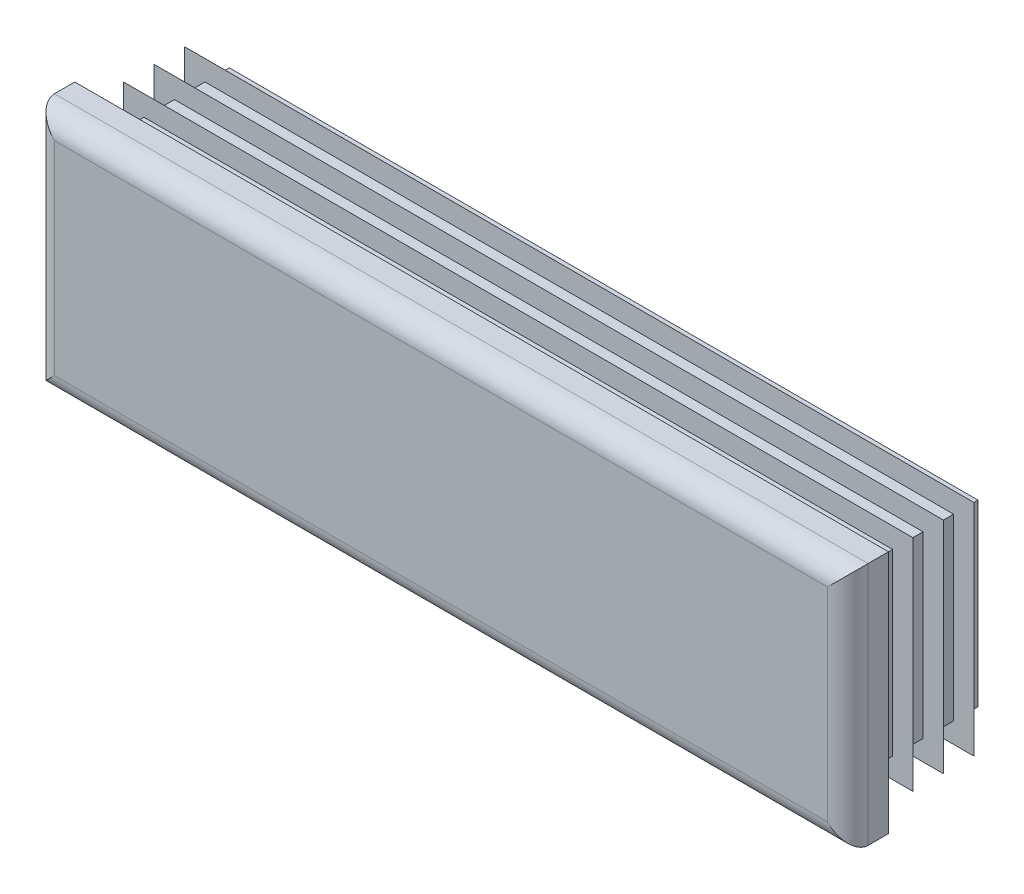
ISO-10303-21;
HEADER;
FILE_DESCRIPTION(('STEP AP214'),'2;1');
FILE_NAME('part.step','',(''),(''),'','','');
FILE_SCHEMA(('AUTOMOTIVE_DESIGN { 1 0 10303 214 1 1 1 1 }'));
ENDSEC;
DATA;
#1=APPLICATION_CONTEXT('core data for automotive mechanical design processes');
#2=APPLICATION_PROTOCOL_DEFINITION('international standard','automotive_design',2000,#1);
#3=PRODUCT_CONTEXT('',#1,'mechanical');
#4=PRODUCT('Part','Part','',(#3));
#5=PRODUCT_RELATED_PRODUCT_CATEGORY('part','',(#4));
#6=PRODUCT_DEFINITION_FORMATION('','',#4);
#7=PRODUCT_DEFINITION_CONTEXT('part definition',#1,'design');
#8=PRODUCT_DEFINITION('design','',#6,#7);
#9=PRODUCT_DEFINITION_SHAPE('','',#8);
#10=(LENGTH_UNIT() NAMED_UNIT(*) SI_UNIT(.MILLI.,.METRE.));
#11=(NAMED_UNIT(*) PLANE_ANGLE_UNIT() SI_UNIT($,.RADIAN.));
#12=(NAMED_UNIT(*) SI_UNIT($,.STERADIAN.) SOLID_ANGLE_UNIT());
#13=UNCERTAINTY_MEASURE_WITH_UNIT(LENGTH_MEASURE(1.E-05),#10,'distance_accuracy_value','');
#14=(GEOMETRIC_REPRESENTATION_CONTEXT(3) GLOBAL_UNCERTAINTY_ASSIGNED_CONTEXT((#13)) GLOBAL_UNIT_ASSIGNED_CONTEXT((#10,
#11,#12)) REPRESENTATION_CONTEXT('',''));
#15=CARTESIAN_POINT('',(0.,0.,0.));
#16=DIRECTION('',(0.,0.,1.));
#17=DIRECTION('',(1.,0.,0.));
#18=AXIS2_PLACEMENT_3D('',#15,#16,#17);
#19=CARTESIAN_POINT('',(47.5,-15.,5.));
#20=DIRECTION('',(0.,0.,-1.));
#21=DIRECTION('',(0.,1.,0.));
#22=AXIS2_PLACEMENT_3D('',#19,#20,#21);
#23=PLANE('',#22);
#24=DIRECTION('',(0.,1.,0.));
#25=VECTOR('',#24,1.);
#26=CARTESIAN_POINT('',(-47.5,-15.,5.));
#27=LINE('',#26,#25);
#28=CARTESIAN_POINT('',(-47.5,-12.5,5.));
#29=VERTEX_POINT('',#28);
#30=CARTESIAN_POINT('',(-47.5,12.5,5.));
#31=VERTEX_POINT('',#30);
#32=EDGE_CURVE('E310',#29,#31,#27,.T.);
#33=ORIENTED_EDGE('',*,*,#32,.F.);
#34=DIRECTION('',(-1.,0.,0.));
#35=VECTOR('',#34,1.);
#36=CARTESIAN_POINT('',(50.,-12.5,5.));
#37=LINE('',#36,#35);
#38=CARTESIAN_POINT('',(47.5,-12.5,5.));
#39=VERTEX_POINT('',#38);
#40=EDGE_CURVE('E482',#39,#29,#37,.T.);
#41=ORIENTED_EDGE('',*,*,#40,.F.);
#42=DIRECTION('',(0.,1.,0.));
#43=VECTOR('',#42,1.);
#44=CARTESIAN_POINT('',(47.5,-15.,5.));
#45=LINE('',#44,#43);
#46=CARTESIAN_POINT('',(47.5,12.5,5.));
#47=VERTEX_POINT('',#46);
#48=EDGE_CURVE('E305',#39,#47,#45,.T.);
#49=ORIENTED_EDGE('',*,*,#48,.T.);
#50=DIRECTION('',(-1.,0.,0.));
#51=VECTOR('',#50,1.);
#52=CARTESIAN_POINT('',(50.,12.5,5.));
#53=LINE('',#52,#51);
#54=EDGE_CURVE('E630',#47,#31,#53,.T.);
#55=ORIENTED_EDGE('',*,*,#54,.T.);
#56=EDGE_LOOP('',(#33,#41,#49,#55));
#57=FACE_BOUND('',#56,.T.);
#58=ADVANCED_FACE('F14',(#57),#23,.F.);
#59=CARTESIAN_POINT('',(-47.5,-15.,2.5));
#60=DIRECTION('',(0.,1.,0.));
#61=DIRECTION('',(-1.,0.,0.));
#62=AXIS2_PLACEMENT_3D('',#59,#60,#61);
#63=CYLINDRICAL_SURFACE('',#62,2.5);
#64=DIRECTION('',(0.,1.,0.));
#65=VECTOR('',#64,1.);
#66=CARTESIAN_POINT('',(-50.,-15.,2.5));
#67=LINE('',#66,#65);
#68=CARTESIAN_POINT('',(-50.,-15.,2.5));
#69=VERTEX_POINT('',#68);
#70=CARTESIAN_POINT('',(-50.,15.,2.5));
#71=VERTEX_POINT('',#70);
#72=EDGE_CURVE('E402',#69,#71,#67,.T.);
#73=ORIENTED_EDGE('',*,*,#72,.F.);
#74=CARTESIAN_POINT('',(-47.5,-12.5,2.5));
#75=DIRECTION('',(-0.707106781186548,0.707106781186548,0.));
#76=DIRECTION('',(0.707106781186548,0.707106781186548,0.));
#77=AXIS2_PLACEMENT_3D('',#74,#75,#76);
#78=ELLIPSE('',#77,3.53553390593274,2.5);
#79=EDGE_CURVE('E59',#69,#29,#78,.T.);
#80=ORIENTED_EDGE('',*,*,#79,.T.);
#81=ORIENTED_EDGE('',*,*,#32,.T.);
#82=CARTESIAN_POINT('',(-47.5,12.5,2.5));
#83=DIRECTION('',(0.707106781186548,0.707106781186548,0.));
#84=DIRECTION('',(-0.707106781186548,0.707106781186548,0.));
#85=AXIS2_PLACEMENT_3D('',#82,#83,#84);
#86=ELLIPSE('',#85,3.53553390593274,2.5);
#87=EDGE_CURVE('E306',#31,#71,#86,.F.);
#88=ORIENTED_EDGE('',*,*,#87,.T.);
#89=EDGE_LOOP('',(#73,#80,#81,#88));
#90=FACE_BOUND('',#89,.T.);
#91=ADVANCED_FACE('F16',(#90),#63,.T.);
#92=CARTESIAN_POINT('',(-50.,-15.,2.5));
#93=DIRECTION('',(1.,0.,0.));
#94=DIRECTION('',(0.,1.,0.));
#95=AXIS2_PLACEMENT_3D('',#92,#93,#94);
#96=PLANE('',#95);
#97=DIRECTION('',(0.,0.,-1.));
#98=VECTOR('',#97,1.);
#99=CARTESIAN_POINT('',(-50.,15.,2.5));
#100=LINE('',#99,#98);
#101=CARTESIAN_POINT('',(-50.,15.,0.));
#102=VERTEX_POINT('',#101);
#103=EDGE_CURVE('E615',#71,#102,#100,.T.);
#104=ORIENTED_EDGE('',*,*,#103,.T.);
#105=DIRECTION('',(0.,1.,0.));
#106=VECTOR('',#105,1.);
#107=CARTESIAN_POINT('',(-50.,-15.,0.));
#108=LINE('',#107,#106);
#109=CARTESIAN_POINT('',(-50.,-15.,0.));
#110=VERTEX_POINT('',#109);
#111=EDGE_CURVE('E400',#110,#102,#108,.T.);
#112=ORIENTED_EDGE('',*,*,#111,.F.);
#113=DIRECTION('',(0.,0.,-1.));
#114=VECTOR('',#113,1.);
#115=CARTESIAN_POINT('',(-50.,-15.,2.5));
#116=LINE('',#115,#114);
#117=EDGE_CURVE('E616',#69,#110,#116,.T.);
#118=ORIENTED_EDGE('',*,*,#117,.F.);
#119=ORIENTED_EDGE('',*,*,#72,.T.);
#120=EDGE_LOOP('',(#104,#112,#118,#119));
#121=FACE_BOUND('',#120,.T.);
#122=ADVANCED_FACE('F697',(#121),#96,.F.);
#123=CARTESIAN_POINT('',(-46.,-15.,0.));
#124=DIRECTION('',(1.,0.,0.));
#125=DIRECTION('',(0.,1.,0.));
#126=AXIS2_PLACEMENT_3D('',#123,#124,#125);
#127=PLANE('',#126);
#128=DIRECTION('',(0.,1.,0.));
#129=VECTOR('',#128,1.);
#130=CARTESIAN_POINT('',(-46.,-15.,0.));
#131=LINE('',#130,#129);
#132=CARTESIAN_POINT('',(-46.,-11.,0.));
#133=VERTEX_POINT('',#132);
#134=CARTESIAN_POINT('',(-46.,11.,0.));
#135=VERTEX_POINT('',#134);
#136=EDGE_CURVE('E397',#133,#135,#131,.T.);
#137=ORIENTED_EDGE('',*,*,#136,.T.);
#138=DIRECTION('',(0.,0.,-1.));
#139=VECTOR('',#138,1.);
#140=CARTESIAN_POINT('',(-46.,11.,0.));
#141=LINE('',#140,#139);
#142=CARTESIAN_POINT('',(-46.,11.,-0.75));
#143=VERTEX_POINT('',#142);
#144=EDGE_CURVE('E495',#135,#143,#141,.T.);
#145=ORIENTED_EDGE('',*,*,#144,.T.);
#146=DIRECTION('',(0.,1.,0.));
#147=VECTOR('',#146,1.);
#148=CARTESIAN_POINT('',(-46.,-15.,-0.75));
#149=LINE('',#148,#147);
#150=CARTESIAN_POINT('',(-46.,-11.,-0.75));
#151=VERTEX_POINT('',#150);
#152=EDGE_CURVE('E394',#151,#143,#149,.T.);
#153=ORIENTED_EDGE('',*,*,#152,.F.);
#154=DIRECTION('',(0.,0.,1.));
#155=VECTOR('',#154,1.);
#156=CARTESIAN_POINT('',(-46.,-11.,0.));
#157=LINE('',#156,#155);
#158=EDGE_CURVE('E489',#151,#133,#157,.T.);
#159=ORIENTED_EDGE('',*,*,#158,.T.);
#160=EDGE_LOOP('',(#137,#145,#153,#159));
#161=FACE_BOUND('',#160,.T.);
#162=ADVANCED_FACE('F787',(#161),#127,.F.);
#163=CARTESIAN_POINT('',(-48.5,-15.,-0.75));
#164=DIRECTION('',(0.342020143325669,0.,0.939692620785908));
#165=DIRECTION('',(-0.939692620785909,0.,0.342020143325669));
#166=AXIS2_PLACEMENT_3D('',#163,#164,#165);
#167=PLANE('',#166);
#168=DIRECTION('',(0.,1.,0.));
#169=VECTOR('',#168,1.);
#170=CARTESIAN_POINT('',(-48.5,-15.,-0.75));
#171=LINE('',#170,#169);
#172=CARTESIAN_POINT('',(-48.5,-13.5,-0.75));
#173=VERTEX_POINT('',#172);
#174=CARTESIAN_POINT('',(-48.5,13.5,-0.75));
#175=VERTEX_POINT('',#174);
#176=EDGE_CURVE('E392',#173,#175,#171,.T.);
#177=ORIENTED_EDGE('',*,*,#176,.T.);
#178=DIRECTION('',(0.844349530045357,-0.438895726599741,-0.307318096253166));
#179=VECTOR('',#178,1.);
#180=CARTESIAN_POINT('',(-37.9384300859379,8.01006042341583,-4.59409707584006));
#181=LINE('',#180,#179);
#182=CARTESIAN_POINT('',(-46.,12.2004915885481,-1.65992558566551));
#183=VERTEX_POINT('',#182);
#184=EDGE_CURVE('E519',#175,#183,#181,.T.);
#185=ORIENTED_EDGE('',*,*,#184,.T.);
#186=DIRECTION('',(0.,1.,0.));
#187=VECTOR('',#186,1.);
#188=CARTESIAN_POINT('',(-46.,-15.,-1.65992558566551));
#189=LINE('',#188,#187);
#190=CARTESIAN_POINT('',(-46.,-12.2004915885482,-1.65992558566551));
#191=VERTEX_POINT('',#190);
#192=EDGE_CURVE('E389',#191,#183,#189,.T.);
#193=ORIENTED_EDGE('',*,*,#192,.F.);
#194=DIRECTION('',(-0.844349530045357,-0.438895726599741,0.307318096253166));
#195=VECTOR('',#194,1.);
#196=CARTESIAN_POINT('',(-49.0558721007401,-13.7889441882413,-0.547679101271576));
#197=LINE('',#196,#195);
#198=EDGE_CURVE('E507',#191,#173,#197,.T.);
#199=ORIENTED_EDGE('',*,*,#198,.T.);
#200=EDGE_LOOP('',(#177,#185,#193,#199));
#201=FACE_BOUND('',#200,.T.);
#202=ADVANCED_FACE('F783',(#201),#167,.F.);
#203=CARTESIAN_POINT('',(-46.,-15.,-1.65992558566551));
#204=DIRECTION('',(1.,0.,0.));
#205=DIRECTION('',(0.,1.,0.));
#206=AXIS2_PLACEMENT_3D('',#203,#204,#205);
#207=PLANE('',#206);
#208=ORIENTED_EDGE('',*,*,#192,.T.);
#209=DIRECTION('',(0.,-0.819152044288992,-0.573576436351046));
#210=VECTOR('',#209,1.);
#211=CARTESIAN_POINT('',(-46.,-6.05131222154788,-14.4399761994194));
#212=LINE('',#211,#210);
#213=CARTESIAN_POINT('',(-46.,11.,-2.50051884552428));
#214=VERTEX_POINT('',#213);
#215=EDGE_CURVE('E516',#183,#214,#212,.T.);
#216=ORIENTED_EDGE('',*,*,#215,.T.);
#217=DIRECTION('',(0.,0.,-1.));
#218=VECTOR('',#217,1.);
#219=CARTESIAN_POINT('',(-46.,11.,-1.65992558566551));
#220=LINE('',#219,#218);
#221=CARTESIAN_POINT('',(-46.,11.,-4.5));
#222=VERTEX_POINT('',#221);
#223=EDGE_CURVE('E525',#214,#222,#220,.T.);
#224=ORIENTED_EDGE('',*,*,#223,.T.);
#225=DIRECTION('',(0.,1.,0.));
#226=VECTOR('',#225,1.);
#227=CARTESIAN_POINT('',(-46.,-15.,-4.5));
#228=LINE('',#227,#226);
#229=CARTESIAN_POINT('',(-46.,-11.,-4.5));
#230=VERTEX_POINT('',#229);
#231=EDGE_CURVE('E386',#230,#222,#228,.T.);
#232=ORIENTED_EDGE('',*,*,#231,.F.);
#233=DIRECTION('',(0.,0.,1.));
#234=VECTOR('',#233,1.);
#235=CARTESIAN_POINT('',(-46.,-11.,-1.65992558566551));
#236=LINE('',#235,#234);
#237=CARTESIAN_POINT('',(-46.,-11.,-2.50051884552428));
#238=VERTEX_POINT('',#237);
#239=EDGE_CURVE('E522',#230,#238,#236,.T.);
#240=ORIENTED_EDGE('',*,*,#239,.T.);
#241=DIRECTION('',(0.,-0.819152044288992,0.573576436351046));
#242=VECTOR('',#241,1.);
#243=CARTESIAN_POINT('',(-46.,-14.0789899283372,-0.344586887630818));
#244=LINE('',#243,#242);
#245=EDGE_CURVE('E504',#238,#191,#244,.T.);
#246=ORIENTED_EDGE('',*,*,#245,.T.);
#247=EDGE_LOOP('',(#208,#216,#224,#232,#240,#246));
#248=FACE_BOUND('',#247,.T.);
#249=ADVANCED_FACE('F779',(#248),#207,.F.);
#250=CARTESIAN_POINT('',(-48.5,-15.,-4.5));
#251=DIRECTION('',(0.342020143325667,0.,0.939692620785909));
#252=DIRECTION('',(-0.939692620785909,0.,0.342020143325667));
#253=AXIS2_PLACEMENT_3D('',#250,#251,#252);
#254=PLANE('',#253);
#255=DIRECTION('',(0.,1.,0.));
#256=VECTOR('',#255,1.);
#257=CARTESIAN_POINT('',(-48.5,-15.,-4.5));
#258=LINE('',#257,#256);
#259=CARTESIAN_POINT('',(-48.5,-13.5,-4.5));
#260=VERTEX_POINT('',#259);
#261=CARTESIAN_POINT('',(-48.5,13.5,-4.5));
#262=VERTEX_POINT('',#261);
#263=EDGE_CURVE('E384',#260,#262,#258,.T.);
#264=ORIENTED_EDGE('',*,*,#263,.T.);
#265=DIRECTION('',(0.844349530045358,-0.43889572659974,-0.307318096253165));
#266=VECTOR('',#265,1.);
#267=CARTESIAN_POINT('',(-37.9384300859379,8.01006042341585,-8.34409707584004));
#268=LINE('',#267,#266);
#269=CARTESIAN_POINT('',(-46.,12.2004915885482,-5.4099255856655));
#270=VERTEX_POINT('',#269);
#271=EDGE_CURVE('E549',#262,#270,#268,.T.);
#272=ORIENTED_EDGE('',*,*,#271,.T.);
#273=DIRECTION('',(0.,1.,0.));
#274=VECTOR('',#273,1.);
#275=CARTESIAN_POINT('',(-46.,-15.,-5.4099255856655));
#276=LINE('',#275,#274);
#277=CARTESIAN_POINT('',(-46.,-12.2004915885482,-5.4099255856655));
#278=VERTEX_POINT('',#277);
#279=EDGE_CURVE('E381',#278,#270,#276,.T.);
#280=ORIENTED_EDGE('',*,*,#279,.F.);
#281=DIRECTION('',(-0.844349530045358,-0.438895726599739,0.307318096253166));
#282=VECTOR('',#281,1.);
#283=CARTESIAN_POINT('',(-49.0558721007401,-13.7889441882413,-4.29767910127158));
#284=LINE('',#283,#282);
#285=EDGE_CURVE('E537',#278,#260,#284,.T.);
#286=ORIENTED_EDGE('',*,*,#285,.T.);
#287=EDGE_LOOP('',(#264,#272,#280,#286));
#288=FACE_BOUND('',#287,.T.);
#289=ADVANCED_FACE('F775',(#288),#254,.F.);
#290=CARTESIAN_POINT('',(-46.,-15.,-5.4099255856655));
#291=DIRECTION('',(1.,0.,0.));
#292=DIRECTION('',(0.,1.,0.));
#293=AXIS2_PLACEMENT_3D('',#290,#291,#292);
#294=PLANE('',#293);
#295=ORIENTED_EDGE('',*,*,#279,.T.);
#296=DIRECTION('',(0.,-0.819152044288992,-0.573576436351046));
#297=VECTOR('',#296,1.);
#298=CARTESIAN_POINT('',(-46.,-6.05131222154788,-18.1899761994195));
#299=LINE('',#298,#297);
#300=CARTESIAN_POINT('',(-46.,11.,-6.25051884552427));
#301=VERTEX_POINT('',#300);
#302=EDGE_CURVE('E546',#270,#301,#299,.T.);
#303=ORIENTED_EDGE('',*,*,#302,.T.);
#304=DIRECTION('',(0.,0.,-1.));
#305=VECTOR('',#304,1.);
#306=CARTESIAN_POINT('',(-46.,11.,-5.4099255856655));
#307=LINE('',#306,#305);
#308=CARTESIAN_POINT('',(-46.,11.,-8.25));
#309=VERTEX_POINT('',#308);
#310=EDGE_CURVE('E555',#301,#309,#307,.T.);
#311=ORIENTED_EDGE('',*,*,#310,.T.);
#312=DIRECTION('',(0.,1.,0.));
#313=VECTOR('',#312,1.);
#314=CARTESIAN_POINT('',(-46.,-15.,-8.25));
#315=LINE('',#314,#313);
#316=CARTESIAN_POINT('',(-46.,-11.,-8.25));
#317=VERTEX_POINT('',#316);
#318=EDGE_CURVE('E378',#317,#309,#315,.T.);
#319=ORIENTED_EDGE('',*,*,#318,.F.);
#320=DIRECTION('',(0.,0.,1.));
#321=VECTOR('',#320,1.);
#322=CARTESIAN_POINT('',(-46.,-11.,-5.4099255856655));
#323=LINE('',#322,#321);
#324=CARTESIAN_POINT('',(-46.,-11.,-6.25051884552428));
#325=VERTEX_POINT('',#324);
#326=EDGE_CURVE('E552',#317,#325,#323,.T.);
#327=ORIENTED_EDGE('',*,*,#326,.T.);
#328=DIRECTION('',(0.,-0.819152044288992,0.573576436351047));
#329=VECTOR('',#328,1.);
#330=CARTESIAN_POINT('',(-46.,-14.0789899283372,-4.09458688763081));
#331=LINE('',#330,#329);
#332=EDGE_CURVE('E534',#325,#278,#331,.T.);
#333=ORIENTED_EDGE('',*,*,#332,.T.);
#334=EDGE_LOOP('',(#295,#303,#311,#319,#327,#333));
#335=FACE_BOUND('',#334,.T.);
#336=ADVANCED_FACE('F771',(#335),#294,.F.);
#337=CARTESIAN_POINT('',(-48.5,-15.,-8.25));
#338=DIRECTION('',(0.342020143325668,0.,0.939692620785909));
#339=DIRECTION('',(-0.939692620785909,0.,0.342020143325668));
#340=AXIS2_PLACEMENT_3D('',#337,#338,#339);
#341=PLANE('',#340);
#342=DIRECTION('',(0.,1.,0.));
#343=VECTOR('',#342,1.);
#344=CARTESIAN_POINT('',(-48.5,-15.,-8.25));
#345=LINE('',#344,#343);
#346=CARTESIAN_POINT('',(-48.5,-13.5,-8.25));
#347=VERTEX_POINT('',#346);
#348=CARTESIAN_POINT('',(-48.5,13.5,-8.25));
#349=VERTEX_POINT('',#348);
#350=EDGE_CURVE('E376',#347,#349,#345,.T.);
#351=ORIENTED_EDGE('',*,*,#350,.T.);
#352=DIRECTION('',(0.844349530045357,-0.43889572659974,-0.307318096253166));
#353=VECTOR('',#352,1.);
#354=CARTESIAN_POINT('',(-37.9384300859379,8.01006042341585,-12.09409707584));
#355=LINE('',#354,#353);
#356=CARTESIAN_POINT('',(-46.,12.2004915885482,-9.1599255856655));
#357=VERTEX_POINT('',#356);
#358=EDGE_CURVE('E579',#349,#357,#355,.T.);
#359=ORIENTED_EDGE('',*,*,#358,.T.);
#360=DIRECTION('',(0.,1.,0.));
#361=VECTOR('',#360,1.);
#362=CARTESIAN_POINT('',(-46.,-15.,-9.1599255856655));
#363=LINE('',#362,#361);
#364=CARTESIAN_POINT('',(-46.,-12.2004915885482,-9.1599255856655));
#365=VERTEX_POINT('',#364);
#366=EDGE_CURVE('E373',#365,#357,#363,.T.);
#367=ORIENTED_EDGE('',*,*,#366,.F.);
#368=DIRECTION('',(-0.844349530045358,-0.43889572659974,0.307318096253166));
#369=VECTOR('',#368,1.);
#370=CARTESIAN_POINT('',(-49.0558721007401,-13.7889441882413,-8.04767910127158));
#371=LINE('',#370,#369);
#372=EDGE_CURVE('E567',#365,#347,#371,.T.);
#373=ORIENTED_EDGE('',*,*,#372,.T.);
#374=EDGE_LOOP('',(#351,#359,#367,#373));
#375=FACE_BOUND('',#374,.T.);
#376=ADVANCED_FACE('F767',(#375),#341,.F.);
#377=CARTESIAN_POINT('',(-46.,-15.,-9.1599255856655));
#378=DIRECTION('',(1.,0.,0.));
#379=DIRECTION('',(0.,1.,0.));
#380=AXIS2_PLACEMENT_3D('',#377,#378,#379);
#381=PLANE('',#380);
#382=ORIENTED_EDGE('',*,*,#366,.T.);
#383=DIRECTION('',(0.,-0.819152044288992,-0.573576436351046));
#384=VECTOR('',#383,1.);
#385=CARTESIAN_POINT('',(-46.,-6.05131222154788,-21.9399761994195));
#386=LINE('',#385,#384);
#387=CARTESIAN_POINT('',(-46.,11.,-10.0005188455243));
#388=VERTEX_POINT('',#387);
#389=EDGE_CURVE('E576',#357,#388,#386,.T.);
#390=ORIENTED_EDGE('',*,*,#389,.T.);
#391=DIRECTION('',(0.,0.,-1.));
#392=VECTOR('',#391,1.);
#393=CARTESIAN_POINT('',(-46.,11.,-9.1599255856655));
#394=LINE('',#393,#392);
#395=CARTESIAN_POINT('',(-46.,11.,-12.));
#396=VERTEX_POINT('',#395);
#397=EDGE_CURVE('E585',#388,#396,#394,.T.);
#398=ORIENTED_EDGE('',*,*,#397,.T.);
#399=DIRECTION('',(0.,1.,0.));
#400=VECTOR('',#399,1.);
#401=CARTESIAN_POINT('',(-46.,-15.,-12.));
#402=LINE('',#401,#400);
#403=CARTESIAN_POINT('',(-46.,-11.,-12.));
#404=VERTEX_POINT('',#403);
#405=EDGE_CURVE('E370',#404,#396,#402,.T.);
#406=ORIENTED_EDGE('',*,*,#405,.F.);
#407=DIRECTION('',(0.,0.,1.));
#408=VECTOR('',#407,1.);
#409=CARTESIAN_POINT('',(-46.,-11.,-9.1599255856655));
#410=LINE('',#409,#408);
#411=CARTESIAN_POINT('',(-46.,-11.,-10.0005188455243));
#412=VERTEX_POINT('',#411);
#413=EDGE_CURVE('E582',#404,#412,#410,.T.);
#414=ORIENTED_EDGE('',*,*,#413,.T.);
#415=DIRECTION('',(0.,-0.819152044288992,0.573576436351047));
#416=VECTOR('',#415,1.);
#417=CARTESIAN_POINT('',(-46.,-14.0789899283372,-7.84458688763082));
#418=LINE('',#417,#416);
#419=EDGE_CURVE('E564',#412,#365,#418,.T.);
#420=ORIENTED_EDGE('',*,*,#419,.T.);
#421=EDGE_LOOP('',(#382,#390,#398,#406,#414,#420));
#422=FACE_BOUND('',#421,.T.);
#423=ADVANCED_FACE('F764',(#422),#381,.F.);
#424=CARTESIAN_POINT('',(-48.5,-15.,-12.));
#425=DIRECTION('',(0.342020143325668,0.,0.939692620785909));
#426=DIRECTION('',(-0.939692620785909,0.,0.342020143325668));
#427=AXIS2_PLACEMENT_3D('',#424,#425,#426);
#428=PLANE('',#427);
#429=DIRECTION('',(0.,1.,0.));
#430=VECTOR('',#429,1.);
#431=CARTESIAN_POINT('',(-48.5,-15.,-12.));
#432=LINE('',#431,#430);
#433=CARTESIAN_POINT('',(-48.5,-13.5,-12.));
#434=VERTEX_POINT('',#433);
#435=CARTESIAN_POINT('',(-48.5,13.5,-12.));
#436=VERTEX_POINT('',#435);
#437=EDGE_CURVE('E368',#434,#436,#432,.T.);
#438=ORIENTED_EDGE('',*,*,#437,.T.);
#439=DIRECTION('',(0.844349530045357,-0.43889572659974,-0.307318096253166));
#440=VECTOR('',#439,1.);
#441=CARTESIAN_POINT('',(-37.9384300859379,8.01006042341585,-15.8440970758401));
#442=LINE('',#441,#440);
#443=CARTESIAN_POINT('',(-46.,12.2004915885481,-12.9099255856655));
#444=VERTEX_POINT('',#443);
#445=EDGE_CURVE('E607',#436,#444,#442,.T.);
#446=ORIENTED_EDGE('',*,*,#445,.T.);
#447=DIRECTION('',(0.,1.,0.));
#448=VECTOR('',#447,1.);
#449=CARTESIAN_POINT('',(-46.,-15.,-12.9099255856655));
#450=LINE('',#449,#448);
#451=CARTESIAN_POINT('',(-46.,-12.2004915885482,-12.9099255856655));
#452=VERTEX_POINT('',#451);
#453=EDGE_CURVE('E365',#452,#444,#450,.T.);
#454=ORIENTED_EDGE('',*,*,#453,.F.);
#455=DIRECTION('',(-0.844349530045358,-0.438895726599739,0.307318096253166));
#456=VECTOR('',#455,1.);
#457=CARTESIAN_POINT('',(-49.0558721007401,-13.7889441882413,-11.7976791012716));
#458=LINE('',#457,#456);
#459=EDGE_CURVE('E595',#452,#434,#458,.T.);
#460=ORIENTED_EDGE('',*,*,#459,.T.);
#461=EDGE_LOOP('',(#438,#446,#454,#460));
#462=FACE_BOUND('',#461,.T.);
#463=ADVANCED_FACE('F675',(#462),#428,.F.);
#464=CARTESIAN_POINT('',(-46.,-15.,-12.9099255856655));
#465=DIRECTION('',(1.,0.,0.));
#466=DIRECTION('',(0.,1.,0.));
#467=AXIS2_PLACEMENT_3D('',#464,#465,#466);
#468=PLANE('',#467);
#469=ORIENTED_EDGE('',*,*,#453,.T.);
#470=DIRECTION('',(0.,-0.819152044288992,-0.573576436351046));
#471=VECTOR('',#470,1.);
#472=CARTESIAN_POINT('',(-46.,-6.05131222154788,-25.6899761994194));
#473=LINE('',#472,#471);
#474=CARTESIAN_POINT('',(-46.,11.,-13.7505188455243));
#475=VERTEX_POINT('',#474);
#476=EDGE_CURVE('E604',#444,#475,#473,.T.);
#477=ORIENTED_EDGE('',*,*,#476,.T.);
#478=DIRECTION('',(0.,0.,-1.));
#479=VECTOR('',#478,1.);
#480=CARTESIAN_POINT('',(-46.,11.,-12.9099255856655));
#481=LINE('',#480,#479);
#482=CARTESIAN_POINT('',(-46.,11.,-15.));
#483=VERTEX_POINT('',#482);
#484=EDGE_CURVE('E613',#475,#483,#481,.T.);
#485=ORIENTED_EDGE('',*,*,#484,.T.);
#486=DIRECTION('',(0.,1.,0.));
#487=VECTOR('',#486,1.);
#488=CARTESIAN_POINT('',(-46.,-15.,-15.));
#489=LINE('',#488,#487);
#490=CARTESIAN_POINT('',(-46.,-11.,-15.));
#491=VERTEX_POINT('',#490);
#492=EDGE_CURVE('E362',#491,#483,#489,.T.);
#493=ORIENTED_EDGE('',*,*,#492,.F.);
#494=DIRECTION('',(0.,0.,1.));
#495=VECTOR('',#494,1.);
#496=CARTESIAN_POINT('',(-46.,-11.,-12.9099255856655));
#497=LINE('',#496,#495);
#498=CARTESIAN_POINT('',(-46.,-11.,-13.7505188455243));
#499=VERTEX_POINT('',#498);
#500=EDGE_CURVE('E610',#491,#499,#497,.T.);
#501=ORIENTED_EDGE('',*,*,#500,.T.);
#502=DIRECTION('',(0.,-0.819152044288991,0.573576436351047));
#503=VECTOR('',#502,1.);
#504=CARTESIAN_POINT('',(-46.,-14.0789899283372,-11.5945868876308));
#505=LINE('',#504,#503);
#506=EDGE_CURVE('E592',#499,#452,#505,.T.);
#507=ORIENTED_EDGE('',*,*,#506,.T.);
#508=EDGE_LOOP('',(#469,#477,#485,#493,#501,#507));
#509=FACE_BOUND('',#508,.T.);
#510=ADVANCED_FACE('F677',(#509),#468,.F.);
#511=CARTESIAN_POINT('',(-46.,-15.,-15.));
#512=DIRECTION('',(0.,0.,1.));
#513=DIRECTION('',(0.,-1.,0.));
#514=AXIS2_PLACEMENT_3D('',#511,#512,#513);
#515=PLANE('',#514);
#516=ORIENTED_EDGE('',*,*,#492,.T.);
#517=DIRECTION('',(-1.,0.,0.));
#518=VECTOR('',#517,1.);
#519=CARTESIAN_POINT('',(50.,11.,-15.));
#520=LINE('',#519,#518);
#521=CARTESIAN_POINT('',(46.,11.,-15.));
#522=VERTEX_POINT('',#521);
#523=EDGE_CURVE('E438',#522,#483,#520,.T.);
#524=ORIENTED_EDGE('',*,*,#523,.F.);
#525=DIRECTION('',(0.,1.,0.));
#526=VECTOR('',#525,1.);
#527=CARTESIAN_POINT('',(46.,-15.,-15.));
#528=LINE('',#527,#526);
#529=CARTESIAN_POINT('',(46.,-11.,-15.));
#530=VERTEX_POINT('',#529);
#531=EDGE_CURVE('E359',#530,#522,#528,.T.);
#532=ORIENTED_EDGE('',*,*,#531,.F.);
#533=DIRECTION('',(-1.,0.,0.));
#534=VECTOR('',#533,1.);
#535=CARTESIAN_POINT('',(50.,-11.,-15.));
#536=LINE('',#535,#534);
#537=EDGE_CURVE('E436',#530,#491,#536,.T.);
#538=ORIENTED_EDGE('',*,*,#537,.T.);
#539=EDGE_LOOP('',(#516,#524,#532,#538));
#540=FACE_BOUND('',#539,.T.);
#541=ADVANCED_FACE('F435',(#540),#515,.F.);
#542=CARTESIAN_POINT('',(46.,-15.,-15.));
#543=DIRECTION('',(-1.,0.,0.));
#544=DIRECTION('',(0.,-1.,0.));
#545=AXIS2_PLACEMENT_3D('',#542,#543,#544);
#546=PLANE('',#545);
#547=DIRECTION('',(0.,0.,1.));
#548=VECTOR('',#547,1.);
#549=CARTESIAN_POINT('',(46.,11.,-15.));
#550=LINE('',#549,#548);
#551=CARTESIAN_POINT('',(46.,11.,-13.7505188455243));
#552=VERTEX_POINT('',#551);
#553=EDGE_CURVE('E9',#522,#552,#550,.T.);
#554=ORIENTED_EDGE('',*,*,#553,.T.);
#555=DIRECTION('',(0.,0.819152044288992,0.573576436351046));
#556=VECTOR('',#555,1.);
#557=CARTESIAN_POINT('',(46.,-7.03332597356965,-26.3775896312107));
#558=LINE('',#557,#556);
#559=CARTESIAN_POINT('',(46.,12.2004915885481,-12.9099255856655));
#560=VERTEX_POINT('',#559);
#561=EDGE_CURVE('E601',#552,#560,#558,.T.);
#562=ORIENTED_EDGE('',*,*,#561,.T.);
#563=DIRECTION('',(0.,1.,0.));
#564=VECTOR('',#563,1.);
#565=CARTESIAN_POINT('',(46.,-15.,-12.9099255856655));
#566=LINE('',#565,#564);
#567=CARTESIAN_POINT('',(46.,-12.2004915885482,-12.9099255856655));
#568=VERTEX_POINT('',#567);
#569=EDGE_CURVE('E356',#568,#560,#566,.T.);
#570=ORIENTED_EDGE('',*,*,#569,.F.);
#571=DIRECTION('',(0.,0.819152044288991,-0.573576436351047));
#572=VECTOR('',#571,1.);
#573=CARTESIAN_POINT('',(46.,-13.0969761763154,-12.2822003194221));
#574=LINE('',#573,#572);
#575=CARTESIAN_POINT('',(46.,-11.,-13.7505188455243));
#576=VERTEX_POINT('',#575);
#577=EDGE_CURVE('E428',#568,#576,#574,.T.);
#578=ORIENTED_EDGE('',*,*,#577,.T.);
#579=DIRECTION('',(0.,0.,-1.));
#580=VECTOR('',#579,1.);
#581=CARTESIAN_POINT('',(46.,-11.,-15.));
#582=LINE('',#581,#580);
#583=EDGE_CURVE('E23',#576,#530,#582,.T.);
#584=ORIENTED_EDGE('',*,*,#583,.T.);
#585=ORIENTED_EDGE('',*,*,#531,.T.);
#586=EDGE_LOOP('',(#554,#562,#570,#578,#584,#585));
#587=FACE_BOUND('',#586,.T.);
#588=ADVANCED_FACE('F426',(#587),#546,.F.);
#589=CARTESIAN_POINT('',(46.,-15.,-12.9099255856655));
#590=DIRECTION('',(-0.342020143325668,0.,0.939692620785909));
#591=DIRECTION('',(-0.939692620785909,0.,-0.342020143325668));
#592=AXIS2_PLACEMENT_3D('',#589,#590,#591);
#593=PLANE('',#592);
#594=ORIENTED_EDGE('',*,*,#569,.T.);
#595=DIRECTION('',(0.844349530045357,0.43889572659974,0.307318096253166));
#596=VECTOR('',#595,1.);
#597=CARTESIAN_POINT('',(35.9200037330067,6.96087561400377,-16.5787441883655));
#598=LINE('',#597,#596);
#599=CARTESIAN_POINT('',(48.5,13.5,-12.));
#600=VERTEX_POINT('',#599);
#601=EDGE_CURVE('E598',#560,#600,#598,.T.);
#602=ORIENTED_EDGE('',*,*,#601,.T.);
#603=DIRECTION('',(0.,1.,0.));
#604=VECTOR('',#603,1.);
#605=CARTESIAN_POINT('',(48.5,-15.,-12.));
#606=LINE('',#605,#604);
#607=CARTESIAN_POINT('',(48.5,-13.5,-12.));
#608=VERTEX_POINT('',#607);
#609=EDGE_CURVE('E353',#608,#600,#606,.T.);
#610=ORIENTED_EDGE('',*,*,#609,.F.);
#611=DIRECTION('',(-0.844349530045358,0.438895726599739,-0.307318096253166));
#612=VECTOR('',#611,1.);
#613=CARTESIAN_POINT('',(47.0374457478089,-12.7397593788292,-12.532326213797));
#614=LINE('',#613,#612);
#615=EDGE_CURVE('E588',#608,#568,#614,.T.);
#616=ORIENTED_EDGE('',*,*,#615,.T.);
#617=EDGE_LOOP('',(#594,#602,#610,#616));
#618=FACE_BOUND('',#617,.T.);
#619=ADVANCED_FACE('F752',(#618),#593,.F.);
#620=CARTESIAN_POINT('',(48.5,-15.,-12.));
#621=DIRECTION('',(0.,0.,-1.));
#622=DIRECTION('',(0.,1.,0.));
#623=AXIS2_PLACEMENT_3D('',#620,#621,#622);
#624=PLANE('',#623);
#625=ORIENTED_EDGE('',*,*,#609,.T.);
#626=DIRECTION('',(-1.,0.,0.));
#627=VECTOR('',#626,1.);
#628=CARTESIAN_POINT('',(50.,13.5,-12.));
#629=LINE('',#628,#627);
#630=EDGE_CURVE('E444',#600,#436,#629,.T.);
#631=ORIENTED_EDGE('',*,*,#630,.T.);
#632=ORIENTED_EDGE('',*,*,#437,.F.);
#633=DIRECTION('',(-1.,0.,0.));
#634=VECTOR('',#633,1.);
#635=CARTESIAN_POINT('',(50.,-13.5,-12.));
#636=LINE('',#635,#634);
#637=EDGE_CURVE('E451',#608,#434,#636,.T.);
#638=ORIENTED_EDGE('',*,*,#637,.F.);
#639=EDGE_LOOP('',(#625,#631,#632,#638));
#640=FACE_BOUND('',#639,.T.);
#641=ORIENTED_EDGE('',*,*,#405,.T.);
#642=DIRECTION('',(-1.,0.,0.));
#643=VECTOR('',#642,1.);
#644=CARTESIAN_POINT('',(50.,11.,-12.));
#645=LINE('',#644,#643);
#646=CARTESIAN_POINT('',(46.,11.,-12.));
#647=VERTEX_POINT('',#646);
#648=EDGE_CURVE('E663',#647,#396,#645,.T.);
#649=ORIENTED_EDGE('',*,*,#648,.F.);
#650=DIRECTION('',(0.,1.,0.));
#651=VECTOR('',#650,1.);
#652=CARTESIAN_POINT('',(46.,-15.,-12.));
#653=LINE('',#652,#651);
#654=CARTESIAN_POINT('',(46.,-11.,-12.));
#655=VERTEX_POINT('',#654);
#656=EDGE_CURVE('E350',#655,#647,#653,.T.);
#657=ORIENTED_EDGE('',*,*,#656,.F.);
#658=DIRECTION('',(-1.,0.,0.));
#659=VECTOR('',#658,1.);
#660=CARTESIAN_POINT('',(50.,-11.,-12.));
#661=LINE('',#660,#659);
#662=EDGE_CURVE('E453',#655,#404,#661,.T.);
#663=ORIENTED_EDGE('',*,*,#662,.T.);
#664=EDGE_LOOP('',(#641,#649,#657,#663));
#665=FACE_BOUND('',#664,.T.);
#666=ADVANCED_FACE('F667',(#640,#665),#624,.F.);
#667=CARTESIAN_POINT('',(46.,-15.,-12.));
#668=DIRECTION('',(-1.,0.,0.));
#669=DIRECTION('',(0.,-1.,0.));
#670=AXIS2_PLACEMENT_3D('',#667,#668,#669);
#671=PLANE('',#670);
#672=DIRECTION('',(0.,0.,1.));
#673=VECTOR('',#672,1.);
#674=CARTESIAN_POINT('',(46.,11.,-12.));
#675=LINE('',#674,#673);
#676=CARTESIAN_POINT('',(46.,11.,-10.0005188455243));
#677=VERTEX_POINT('',#676);
#678=EDGE_CURVE('E420',#647,#677,#675,.T.);
#679=ORIENTED_EDGE('',*,*,#678,.T.);
#680=DIRECTION('',(0.,0.819152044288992,0.573576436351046));
#681=VECTOR('',#680,1.);
#682=CARTESIAN_POINT('',(46.,-7.38571070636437,-22.8743320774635));
#683=LINE('',#682,#681);
#684=CARTESIAN_POINT('',(46.,12.2004915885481,-9.15992558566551));
#685=VERTEX_POINT('',#684);
#686=EDGE_CURVE('E573',#677,#685,#683,.T.);
#687=ORIENTED_EDGE('',*,*,#686,.T.);
#688=DIRECTION('',(0.,1.,0.));
#689=VECTOR('',#688,1.);
#690=CARTESIAN_POINT('',(46.,-15.,-9.1599255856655));
#691=LINE('',#690,#689);
#692=CARTESIAN_POINT('',(46.,-12.2004915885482,-9.15992558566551));
#693=VERTEX_POINT('',#692);
#694=EDGE_CURVE('E347',#693,#685,#691,.T.);
#695=ORIENTED_EDGE('',*,*,#694,.F.);
#696=DIRECTION('',(0.,0.819152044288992,-0.573576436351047));
#697=VECTOR('',#696,1.);
#698=CARTESIAN_POINT('',(46.,-12.7445914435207,-8.77894276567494));
#699=LINE('',#698,#697);
#700=CARTESIAN_POINT('',(46.,-11.,-10.0005188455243));
#701=VERTEX_POINT('',#700);
#702=EDGE_CURVE('E561',#693,#701,#699,.T.);
#703=ORIENTED_EDGE('',*,*,#702,.T.);
#704=DIRECTION('',(0.,0.,-1.));
#705=VECTOR('',#704,1.);
#706=CARTESIAN_POINT('',(46.,-11.,-12.));
#707=LINE('',#706,#705);
#708=EDGE_CURVE('E417',#701,#655,#707,.T.);
#709=ORIENTED_EDGE('',*,*,#708,.T.);
#710=ORIENTED_EDGE('',*,*,#656,.T.);
#711=EDGE_LOOP('',(#679,#687,#695,#703,#709,#710));
#712=FACE_BOUND('',#711,.T.);
#713=ADVANCED_FACE('F745',(#712),#671,.F.);
#714=CARTESIAN_POINT('',(46.,-15.,-9.1599255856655));
#715=DIRECTION('',(-0.342020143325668,0.,0.939692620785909));
#716=DIRECTION('',(-0.939692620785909,0.,-0.342020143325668));
#717=AXIS2_PLACEMENT_3D('',#714,#715,#716);
#718=PLANE('',#717);
#719=ORIENTED_EDGE('',*,*,#694,.T.);
#720=DIRECTION('',(0.844349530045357,0.43889572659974,0.307318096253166));
#721=VECTOR('',#720,1.);
#722=CARTESIAN_POINT('',(35.9200037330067,6.96087561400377,-12.8287441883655));
#723=LINE('',#722,#721);
#724=CARTESIAN_POINT('',(48.5,13.5,-8.25));
#725=VERTEX_POINT('',#724);
#726=EDGE_CURVE('E570',#685,#725,#723,.T.);
#727=ORIENTED_EDGE('',*,*,#726,.T.);
#728=DIRECTION('',(0.,1.,0.));
#729=VECTOR('',#728,1.);
#730=CARTESIAN_POINT('',(48.5,-15.,-8.25));
#731=LINE('',#730,#729);
#732=CARTESIAN_POINT('',(48.5,-13.5,-8.25));
#733=VERTEX_POINT('',#732);
#734=EDGE_CURVE('E344',#733,#725,#731,.T.);
#735=ORIENTED_EDGE('',*,*,#734,.F.);
#736=DIRECTION('',(-0.844349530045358,0.43889572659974,-0.307318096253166));
#737=VECTOR('',#736,1.);
#738=CARTESIAN_POINT('',(47.0374457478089,-12.7397593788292,-8.78232621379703));
#739=LINE('',#738,#737);
#740=EDGE_CURVE('E558',#733,#693,#739,.T.);
#741=ORIENTED_EDGE('',*,*,#740,.T.);
#742=EDGE_LOOP('',(#719,#727,#735,#741));
#743=FACE_BOUND('',#742,.T.);
#744=ADVANCED_FACE('F741',(#743),#718,.F.);
#745=CARTESIAN_POINT('',(48.5,-15.,-8.25));
#746=DIRECTION('',(0.,0.,-1.));
#747=DIRECTION('',(0.,1.,0.));
#748=AXIS2_PLACEMENT_3D('',#745,#746,#747);
#749=PLANE('',#748);
#750=ORIENTED_EDGE('',*,*,#734,.T.);
#751=DIRECTION('',(-1.,0.,0.));
#752=VECTOR('',#751,1.);
#753=CARTESIAN_POINT('',(50.,13.5,-8.25));
#754=LINE('',#753,#752);
#755=EDGE_CURVE('E657',#725,#349,#754,.T.);
#756=ORIENTED_EDGE('',*,*,#755,.T.);
#757=ORIENTED_EDGE('',*,*,#350,.F.);
#758=DIRECTION('',(-1.,0.,0.));
#759=VECTOR('',#758,1.);
#760=CARTESIAN_POINT('',(50.,-13.5,-8.25));
#761=LINE('',#760,#759);
#762=EDGE_CURVE('E459',#733,#347,#761,.T.);
#763=ORIENTED_EDGE('',*,*,#762,.F.);
#764=EDGE_LOOP('',(#750,#756,#757,#763));
#765=FACE_BOUND('',#764,.T.);
#766=ORIENTED_EDGE('',*,*,#318,.T.);
#767=DIRECTION('',(-1.,0.,0.));
#768=VECTOR('',#767,1.);
#769=CARTESIAN_POINT('',(50.,11.,-8.25));
#770=LINE('',#769,#768);
#771=CARTESIAN_POINT('',(46.,11.,-8.25));
#772=VERTEX_POINT('',#771);
#773=EDGE_CURVE('E655',#772,#309,#770,.T.);
#774=ORIENTED_EDGE('',*,*,#773,.F.);
#775=DIRECTION('',(0.,1.,0.));
#776=VECTOR('',#775,1.);
#777=CARTESIAN_POINT('',(46.,-15.,-8.25));
#778=LINE('',#777,#776);
#779=CARTESIAN_POINT('',(46.,-11.,-8.25));
#780=VERTEX_POINT('',#779);
#781=EDGE_CURVE('E341',#780,#772,#778,.T.);
#782=ORIENTED_EDGE('',*,*,#781,.F.);
#783=DIRECTION('',(-1.,0.,0.));
#784=VECTOR('',#783,1.);
#785=CARTESIAN_POINT('',(50.,-11.,-8.25));
#786=LINE('',#785,#784);
#787=EDGE_CURVE('E461',#780,#317,#786,.T.);
#788=ORIENTED_EDGE('',*,*,#787,.T.);
#789=EDGE_LOOP('',(#766,#774,#782,#788));
#790=FACE_BOUND('',#789,.T.);
#791=ADVANCED_FACE('F737',(#765,#790),#749,.F.);
#792=CARTESIAN_POINT('',(46.,-15.,-8.25));
#793=DIRECTION('',(-1.,0.,0.));
#794=DIRECTION('',(0.,-1.,0.));
#795=AXIS2_PLACEMENT_3D('',#792,#793,#794);
#796=PLANE('',#795);
#797=DIRECTION('',(0.,0.,1.));
#798=VECTOR('',#797,1.);
#799=CARTESIAN_POINT('',(46.,11.,-8.25));
#800=LINE('',#799,#798);
#801=CARTESIAN_POINT('',(46.,11.,-6.25051884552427));
#802=VERTEX_POINT('',#801);
#803=EDGE_CURVE('E414',#772,#802,#800,.T.);
#804=ORIENTED_EDGE('',*,*,#803,.T.);
#805=DIRECTION('',(0.,0.819152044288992,0.573576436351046));
#806=VECTOR('',#805,1.);
#807=CARTESIAN_POINT('',(46.,-7.38571070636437,-19.1243320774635));
#808=LINE('',#807,#806);
#809=CARTESIAN_POINT('',(46.,12.2004915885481,-5.40992558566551));
#810=VERTEX_POINT('',#809);
#811=EDGE_CURVE('E543',#802,#810,#808,.T.);
#812=ORIENTED_EDGE('',*,*,#811,.T.);
#813=DIRECTION('',(0.,1.,0.));
#814=VECTOR('',#813,1.);
#815=CARTESIAN_POINT('',(46.,-15.,-5.40992558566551));
#816=LINE('',#815,#814);
#817=CARTESIAN_POINT('',(46.,-12.2004915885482,-5.40992558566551));
#818=VERTEX_POINT('',#817);
#819=EDGE_CURVE('E338',#818,#810,#816,.T.);
#820=ORIENTED_EDGE('',*,*,#819,.F.);
#821=DIRECTION('',(0.,0.819152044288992,-0.573576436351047));
#822=VECTOR('',#821,1.);
#823=CARTESIAN_POINT('',(46.,-12.7445914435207,-5.02894276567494));
#824=LINE('',#823,#822);
#825=CARTESIAN_POINT('',(46.,-11.,-6.25051884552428));
#826=VERTEX_POINT('',#825);
#827=EDGE_CURVE('E531',#818,#826,#824,.T.);
#828=ORIENTED_EDGE('',*,*,#827,.T.);
#829=DIRECTION('',(0.,0.,-1.));
#830=VECTOR('',#829,1.);
#831=CARTESIAN_POINT('',(46.,-11.,-8.25));
#832=LINE('',#831,#830);
#833=EDGE_CURVE('E411',#826,#780,#832,.T.);
#834=ORIENTED_EDGE('',*,*,#833,.T.);
#835=ORIENTED_EDGE('',*,*,#781,.T.);
#836=EDGE_LOOP('',(#804,#812,#820,#828,#834,#835));
#837=FACE_BOUND('',#836,.T.);
#838=ADVANCED_FACE('F733',(#837),#796,.F.);
#839=CARTESIAN_POINT('',(46.,-15.,-5.40992558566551));
#840=DIRECTION('',(-0.342020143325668,0.,0.939692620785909));
#841=DIRECTION('',(-0.939692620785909,0.,-0.342020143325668));
#842=AXIS2_PLACEMENT_3D('',#839,#840,#841);
#843=PLANE('',#842);
#844=ORIENTED_EDGE('',*,*,#819,.T.);
#845=DIRECTION('',(0.844349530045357,0.438895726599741,0.307318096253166));
#846=VECTOR('',#845,1.);
#847=CARTESIAN_POINT('',(35.9200037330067,6.96087561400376,-9.0787441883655));
#848=LINE('',#847,#846);
#849=CARTESIAN_POINT('',(48.5,13.5,-4.5));
#850=VERTEX_POINT('',#849);
#851=EDGE_CURVE('E540',#810,#850,#848,.T.);
#852=ORIENTED_EDGE('',*,*,#851,.T.);
#853=DIRECTION('',(0.,1.,0.));
#854=VECTOR('',#853,1.);
#855=CARTESIAN_POINT('',(48.5,-15.,-4.5));
#856=LINE('',#855,#854);
#857=CARTESIAN_POINT('',(48.5,-13.5,-4.5));
#858=VERTEX_POINT('',#857);
#859=EDGE_CURVE('E335',#858,#850,#856,.T.);
#860=ORIENTED_EDGE('',*,*,#859,.F.);
#861=DIRECTION('',(-0.844349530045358,0.43889572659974,-0.307318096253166));
#862=VECTOR('',#861,1.);
#863=CARTESIAN_POINT('',(47.0374457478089,-12.7397593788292,-5.03232621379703));
#864=LINE('',#863,#862);
#865=EDGE_CURVE('E528',#858,#818,#864,.T.);
#866=ORIENTED_EDGE('',*,*,#865,.T.);
#867=EDGE_LOOP('',(#844,#852,#860,#866));
#868=FACE_BOUND('',#867,.T.);
#869=ADVANCED_FACE('F729',(#868),#843,.F.);
#870=CARTESIAN_POINT('',(48.5,-15.,-4.5));
#871=DIRECTION('',(0.,0.,-1.));
#872=DIRECTION('',(0.,1.,0.));
#873=AXIS2_PLACEMENT_3D('',#870,#871,#872);
#874=PLANE('',#873);
#875=ORIENTED_EDGE('',*,*,#859,.T.);
#876=DIRECTION('',(-1.,0.,0.));
#877=VECTOR('',#876,1.);
#878=CARTESIAN_POINT('',(50.,13.5,-4.5));
#879=LINE('',#878,#877);
#880=EDGE_CURVE('E649',#850,#262,#879,.T.);
#881=ORIENTED_EDGE('',*,*,#880,.T.);
#882=ORIENTED_EDGE('',*,*,#263,.F.);
#883=DIRECTION('',(-1.,0.,0.));
#884=VECTOR('',#883,1.);
#885=CARTESIAN_POINT('',(50.,-13.5,-4.5));
#886=LINE('',#885,#884);
#887=EDGE_CURVE('E467',#858,#260,#886,.T.);
#888=ORIENTED_EDGE('',*,*,#887,.F.);
#889=EDGE_LOOP('',(#875,#881,#882,#888));
#890=FACE_BOUND('',#889,.T.);
#891=ORIENTED_EDGE('',*,*,#231,.T.);
#892=DIRECTION('',(-1.,0.,0.));
#893=VECTOR('',#892,1.);
#894=CARTESIAN_POINT('',(50.,11.,-4.5));
#895=LINE('',#894,#893);
#896=CARTESIAN_POINT('',(46.,11.,-4.5));
#897=VERTEX_POINT('',#896);
#898=EDGE_CURVE('E647',#897,#222,#895,.T.);
#899=ORIENTED_EDGE('',*,*,#898,.F.);
#900=DIRECTION('',(0.,1.,0.));
#901=VECTOR('',#900,1.);
#902=CARTESIAN_POINT('',(46.,-15.,-4.5));
#903=LINE('',#902,#901);
#904=CARTESIAN_POINT('',(46.,-11.,-4.5));
#905=VERTEX_POINT('',#904);
#906=EDGE_CURVE('E332',#905,#897,#903,.T.);
#907=ORIENTED_EDGE('',*,*,#906,.F.);
#908=DIRECTION('',(-1.,0.,0.));
#909=VECTOR('',#908,1.);
#910=CARTESIAN_POINT('',(50.,-11.,-4.5));
#911=LINE('',#910,#909);
#912=EDGE_CURVE('E469',#905,#230,#911,.T.);
#913=ORIENTED_EDGE('',*,*,#912,.T.);
#914=EDGE_LOOP('',(#891,#899,#907,#913));
#915=FACE_BOUND('',#914,.T.);
#916=ADVANCED_FACE('F725',(#890,#915),#874,.F.);
#917=CARTESIAN_POINT('',(46.,-15.,-4.5));
#918=DIRECTION('',(-1.,0.,0.));
#919=DIRECTION('',(0.,-1.,0.));
#920=AXIS2_PLACEMENT_3D('',#917,#918,#919);
#921=PLANE('',#920);
#922=DIRECTION('',(0.,0.,1.));
#923=VECTOR('',#922,1.);
#924=CARTESIAN_POINT('',(46.,11.,-4.5));
#925=LINE('',#924,#923);
#926=CARTESIAN_POINT('',(46.,11.,-2.50051884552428));
#927=VERTEX_POINT('',#926);
#928=EDGE_CURVE('E408',#897,#927,#925,.T.);
#929=ORIENTED_EDGE('',*,*,#928,.T.);
#930=DIRECTION('',(0.,0.819152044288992,0.573576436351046));
#931=VECTOR('',#930,1.);
#932=CARTESIAN_POINT('',(46.,-7.38571070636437,-15.3743320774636));
#933=LINE('',#932,#931);
#934=CARTESIAN_POINT('',(46.,12.2004915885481,-1.65992558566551));
#935=VERTEX_POINT('',#934);
#936=EDGE_CURVE('E513',#927,#935,#933,.T.);
#937=ORIENTED_EDGE('',*,*,#936,.T.);
#938=DIRECTION('',(0.,1.,0.));
#939=VECTOR('',#938,1.);
#940=CARTESIAN_POINT('',(46.,-15.,-1.65992558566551));
#941=LINE('',#940,#939);
#942=CARTESIAN_POINT('',(46.,-12.2004915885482,-1.65992558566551));
#943=VERTEX_POINT('',#942);
#944=EDGE_CURVE('E329',#943,#935,#941,.T.);
#945=ORIENTED_EDGE('',*,*,#944,.F.);
#946=DIRECTION('',(0.,0.819152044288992,-0.573576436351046));
#947=VECTOR('',#946,1.);
#948=CARTESIAN_POINT('',(46.,-12.7445914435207,-1.27894276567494));
#949=LINE('',#948,#947);
#950=CARTESIAN_POINT('',(46.,-11.,-2.50051884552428));
#951=VERTEX_POINT('',#950);
#952=EDGE_CURVE('E501',#943,#951,#949,.T.);
#953=ORIENTED_EDGE('',*,*,#952,.T.);
#954=DIRECTION('',(0.,0.,-1.));
#955=VECTOR('',#954,1.);
#956=CARTESIAN_POINT('',(46.,-11.,-4.5));
#957=LINE('',#956,#955);
#958=EDGE_CURVE('E405',#951,#905,#957,.T.);
#959=ORIENTED_EDGE('',*,*,#958,.T.);
#960=ORIENTED_EDGE('',*,*,#906,.T.);
#961=EDGE_LOOP('',(#929,#937,#945,#953,#959,#960));
#962=FACE_BOUND('',#961,.T.);
#963=ADVANCED_FACE('F721',(#962),#921,.F.);
#964=CARTESIAN_POINT('',(46.,-15.,-1.65992558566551));
#965=DIRECTION('',(-0.342020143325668,0.,0.939692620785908));
#966=DIRECTION('',(-0.939692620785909,0.,-0.342020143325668));
#967=AXIS2_PLACEMENT_3D('',#964,#965,#966);
#968=PLANE('',#967);
#969=ORIENTED_EDGE('',*,*,#944,.T.);
#970=DIRECTION('',(0.844349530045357,0.438895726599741,0.307318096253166));
#971=VECTOR('',#970,1.);
#972=CARTESIAN_POINT('',(35.9200037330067,6.96087561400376,-5.3287441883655));
#973=LINE('',#972,#971);
#974=CARTESIAN_POINT('',(48.5,13.5,-0.75));
#975=VERTEX_POINT('',#974);
#976=EDGE_CURVE('E510',#935,#975,#973,.T.);
#977=ORIENTED_EDGE('',*,*,#976,.T.);
#978=DIRECTION('',(0.,1.,0.));
#979=VECTOR('',#978,1.);
#980=CARTESIAN_POINT('',(48.5,-15.,-0.75));
#981=LINE('',#980,#979);
#982=CARTESIAN_POINT('',(48.5,-13.5,-0.75));
#983=VERTEX_POINT('',#982);
#984=EDGE_CURVE('E326',#983,#975,#981,.T.);
#985=ORIENTED_EDGE('',*,*,#984,.F.);
#986=DIRECTION('',(-0.844349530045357,0.43889572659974,-0.307318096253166));
#987=VECTOR('',#986,1.);
#988=CARTESIAN_POINT('',(47.0374457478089,-12.7397593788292,-1.28232621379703));
#989=LINE('',#988,#987);
#990=EDGE_CURVE('E498',#983,#943,#989,.T.);
#991=ORIENTED_EDGE('',*,*,#990,.T.);
#992=EDGE_LOOP('',(#969,#977,#985,#991));
#993=FACE_BOUND('',#992,.T.);
#994=ADVANCED_FACE('F717',(#993),#968,.F.);
#995=CARTESIAN_POINT('',(48.5,-15.,-0.75));
#996=DIRECTION('',(0.,0.,-1.));
#997=DIRECTION('',(0.,1.,0.));
#998=AXIS2_PLACEMENT_3D('',#995,#996,#997);
#999=PLANE('',#998);
#1000=ORIENTED_EDGE('',*,*,#984,.T.);
#1001=DIRECTION('',(-1.,0.,0.));
#1002=VECTOR('',#1001,1.);
#1003=CARTESIAN_POINT('',(50.,13.5,-0.75));
#1004=LINE('',#1003,#1002);
#1005=EDGE_CURVE('E641',#975,#175,#1004,.T.);
#1006=ORIENTED_EDGE('',*,*,#1005,.T.);
#1007=ORIENTED_EDGE('',*,*,#176,.F.);
#1008=DIRECTION('',(-1.,0.,0.));
#1009=VECTOR('',#1008,1.);
#1010=CARTESIAN_POINT('',(50.,-13.5,-0.75));
#1011=LINE('',#1010,#1009);
#1012=EDGE_CURVE('E475',#983,#173,#1011,.T.);
#1013=ORIENTED_EDGE('',*,*,#1012,.F.);
#1014=EDGE_LOOP('',(#1000,#1006,#1007,#1013));
#1015=FACE_BOUND('',#1014,.T.);
#1016=ORIENTED_EDGE('',*,*,#152,.T.);
#1017=DIRECTION('',(-1.,0.,0.));
#1018=VECTOR('',#1017,1.);
#1019=CARTESIAN_POINT('',(50.,11.,-0.75));
#1020=LINE('',#1019,#1018);
#1021=CARTESIAN_POINT('',(46.,11.,-0.75));
#1022=VERTEX_POINT('',#1021);
#1023=EDGE_CURVE('E639',#1022,#143,#1020,.T.);
#1024=ORIENTED_EDGE('',*,*,#1023,.F.);
#1025=DIRECTION('',(0.,1.,0.));
#1026=VECTOR('',#1025,1.);
#1027=CARTESIAN_POINT('',(46.,-15.,-0.75));
#1028=LINE('',#1027,#1026);
#1029=CARTESIAN_POINT('',(46.,-11.,-0.75));
#1030=VERTEX_POINT('',#1029);
#1031=EDGE_CURVE('E323',#1030,#1022,#1028,.T.);
#1032=ORIENTED_EDGE('',*,*,#1031,.F.);
#1033=DIRECTION('',(-1.,0.,0.));
#1034=VECTOR('',#1033,1.);
#1035=CARTESIAN_POINT('',(50.,-11.,-0.75));
#1036=LINE('',#1035,#1034);
#1037=EDGE_CURVE('E477',#1030,#151,#1036,.T.);
#1038=ORIENTED_EDGE('',*,*,#1037,.T.);
#1039=EDGE_LOOP('',(#1016,#1024,#1032,#1038));
#1040=FACE_BOUND('',#1039,.T.);
#1041=ADVANCED_FACE('F713',(#1015,#1040),#999,.F.);
#1042=CARTESIAN_POINT('',(46.,-15.,-0.75));
#1043=DIRECTION('',(-1.,0.,0.));
#1044=DIRECTION('',(0.,-1.,0.));
#1045=AXIS2_PLACEMENT_3D('',#1042,#1043,#1044);
#1046=PLANE('',#1045);
#1047=ORIENTED_EDGE('',*,*,#1031,.T.);
#1048=DIRECTION('',(0.,0.,1.));
#1049=VECTOR('',#1048,1.);
#1050=CARTESIAN_POINT('',(46.,11.,-0.75));
#1051=LINE('',#1050,#1049);
#1052=CARTESIAN_POINT('',(46.,11.,0.));
#1053=VERTEX_POINT('',#1052);
#1054=EDGE_CURVE('E492',#1022,#1053,#1051,.T.);
#1055=ORIENTED_EDGE('',*,*,#1054,.T.);
#1056=DIRECTION('',(0.,1.,0.));
#1057=VECTOR('',#1056,1.);
#1058=CARTESIAN_POINT('',(46.,-15.,0.));
#1059=LINE('',#1058,#1057);
#1060=CARTESIAN_POINT('',(46.,-11.,0.));
#1061=VERTEX_POINT('',#1060);
#1062=EDGE_CURVE('E316',#1061,#1053,#1059,.T.);
#1063=ORIENTED_EDGE('',*,*,#1062,.F.);
#1064=DIRECTION('',(0.,0.,-1.));
#1065=VECTOR('',#1064,1.);
#1066=CARTESIAN_POINT('',(46.,-11.,-0.75));
#1067=LINE('',#1066,#1065);
#1068=EDGE_CURVE('E486',#1061,#1030,#1067,.T.);
#1069=ORIENTED_EDGE('',*,*,#1068,.T.);
#1070=EDGE_LOOP('',(#1047,#1055,#1063,#1069));
#1071=FACE_BOUND('',#1070,.T.);
#1072=ADVANCED_FACE('F709',(#1071),#1046,.F.);
#1073=CARTESIAN_POINT('',(46.,-15.,0.));
#1074=DIRECTION('',(0.,0.,1.));
#1075=DIRECTION('',(0.,-1.,0.));
#1076=AXIS2_PLACEMENT_3D('',#1073,#1074,#1075);
#1077=PLANE('',#1076);
#1078=DIRECTION('',(-1.,0.,0.));
#1079=VECTOR('',#1078,1.);
#1080=CARTESIAN_POINT('',(50.,11.,0.));
#1081=LINE('',#1080,#1079);
#1082=EDGE_CURVE('E634',#1053,#135,#1081,.T.);
#1083=ORIENTED_EDGE('',*,*,#1082,.T.);
#1084=ORIENTED_EDGE('',*,*,#136,.F.);
#1085=DIRECTION('',(-1.,0.,0.));
#1086=VECTOR('',#1085,1.);
#1087=CARTESIAN_POINT('',(50.,-11.,0.));
#1088=LINE('',#1087,#1086);
#1089=EDGE_CURVE('E296',#1061,#133,#1088,.T.);
#1090=ORIENTED_EDGE('',*,*,#1089,.F.);
#1091=ORIENTED_EDGE('',*,*,#1062,.T.);
#1092=EDGE_LOOP('',(#1083,#1084,#1090,#1091));
#1093=FACE_BOUND('',#1092,.T.);
#1094=ORIENTED_EDGE('',*,*,#111,.T.);
#1095=DIRECTION('',(1.,0.,0.));
#1096=VECTOR('',#1095,1.);
#1097=CARTESIAN_POINT('',(46.,15.,0.));
#1098=LINE('',#1097,#1096);
#1099=CARTESIAN_POINT('',(50.,15.,0.));
#1100=VERTEX_POINT('',#1099);
#1101=EDGE_CURVE('E621',#102,#1100,#1098,.T.);
#1102=ORIENTED_EDGE('',*,*,#1101,.T.);
#1103=DIRECTION('',(0.,1.,0.));
#1104=VECTOR('',#1103,1.);
#1105=CARTESIAN_POINT('',(50.,-15.,0.));
#1106=LINE('',#1105,#1104);
#1107=CARTESIAN_POINT('',(50.,-15.,0.));
#1108=VERTEX_POINT('',#1107);
#1109=EDGE_CURVE('E45',#1108,#1100,#1106,.T.);
#1110=ORIENTED_EDGE('',*,*,#1109,.F.);
#1111=DIRECTION('',(1.,0.,0.));
#1112=VECTOR('',#1111,1.);
#1113=CARTESIAN_POINT('',(-50.,-15.,0.));
#1114=LINE('',#1113,#1112);
#1115=EDGE_CURVE('E31',#110,#1108,#1114,.T.);
#1116=ORIENTED_EDGE('',*,*,#1115,.F.);
#1117=EDGE_LOOP('',(#1094,#1102,#1110,#1116));
#1118=FACE_BOUND('',#1117,.T.);
#1119=ADVANCED_FACE('F706',(#1093,#1118),#1077,.F.);
#1120=CARTESIAN_POINT('',(50.,-15.,0.));
#1121=DIRECTION('',(-1.,0.,0.));
#1122=DIRECTION('',(0.,-1.,0.));
#1123=AXIS2_PLACEMENT_3D('',#1120,#1121,#1122);
#1124=PLANE('',#1123);
#1125=DIRECTION('',(0.,0.,1.));
#1126=VECTOR('',#1125,1.);
#1127=CARTESIAN_POINT('',(50.,15.,0.));
#1128=LINE('',#1127,#1126);
#1129=CARTESIAN_POINT('',(50.,15.,2.5));
#1130=VERTEX_POINT('',#1129);
#1131=EDGE_CURVE('E314',#1100,#1130,#1128,.T.);
#1132=ORIENTED_EDGE('',*,*,#1131,.T.);
#1133=DIRECTION('',(0.,1.,0.));
#1134=VECTOR('',#1133,1.);
#1135=CARTESIAN_POINT('',(50.,-15.,2.5));
#1136=LINE('',#1135,#1134);
#1137=CARTESIAN_POINT('',(50.,-15.,2.5));
#1138=VERTEX_POINT('',#1137);
#1139=EDGE_CURVE('E303',#1138,#1130,#1136,.T.);
#1140=ORIENTED_EDGE('',*,*,#1139,.F.);
#1141=DIRECTION('',(0.,0.,1.));
#1142=VECTOR('',#1141,1.);
#1143=CARTESIAN_POINT('',(50.,-15.,0.));
#1144=LINE('',#1143,#1142);
#1145=EDGE_CURVE('E308',#1108,#1138,#1144,.T.);
#1146=ORIENTED_EDGE('',*,*,#1145,.F.);
#1147=ORIENTED_EDGE('',*,*,#1109,.T.);
#1148=EDGE_LOOP('',(#1132,#1140,#1146,#1147));
#1149=FACE_BOUND('',#1148,.T.);
#1150=ADVANCED_FACE('F312',(#1149),#1124,.F.);
#1151=CARTESIAN_POINT('',(47.5,-15.,2.5));
#1152=DIRECTION('',(0.,1.,0.));
#1153=DIRECTION('',(-1.,0.,0.));
#1154=AXIS2_PLACEMENT_3D('',#1151,#1152,#1153);
#1155=CYLINDRICAL_SURFACE('',#1154,2.5);
#1156=ORIENTED_EDGE('',*,*,#48,.F.);
#1157=CARTESIAN_POINT('',(47.5,-12.5,2.5));
#1158=DIRECTION('',(0.707106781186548,0.707106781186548,0.));
#1159=DIRECTION('',(-0.707106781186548,0.707106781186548,0.));
#1160=AXIS2_PLACEMENT_3D('',#1157,#1158,#1159);
#1161=ELLIPSE('',#1160,3.53553390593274,2.5);
#1162=EDGE_CURVE('E293',#39,#1138,#1161,.T.);
#1163=ORIENTED_EDGE('',*,*,#1162,.T.);
#1164=ORIENTED_EDGE('',*,*,#1139,.T.);
#1165=CARTESIAN_POINT('',(47.5,12.5,2.5));
#1166=DIRECTION('',(-0.707106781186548,0.707106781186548,0.));
#1167=DIRECTION('',(0.707106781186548,0.707106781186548,0.));
#1168=AXIS2_PLACEMENT_3D('',#1165,#1166,#1167);
#1169=ELLIPSE('',#1168,3.53553390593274,2.5);
#1170=EDGE_CURVE('E52',#1130,#47,#1169,.F.);
#1171=ORIENTED_EDGE('',*,*,#1170,.T.);
#1172=EDGE_LOOP('',(#1156,#1163,#1164,#1171));
#1173=FACE_BOUND('',#1172,.T.);
#1174=ADVANCED_FACE('F301',(#1173),#1155,.T.);
#1175=CARTESIAN_POINT('',(-47.5,-15.,2.5));
#1176=DIRECTION('',(0.,-1.,0.));
#1177=DIRECTION('',(1.,0.,0.));
#1178=AXIS2_PLACEMENT_3D('',#1175,#1176,#1177);
#1179=PLANE('',#1178);
#1180=DIRECTION('',(-1.,0.,0.));
#1181=VECTOR('',#1180,1.);
#1182=CARTESIAN_POINT('',(50.,-15.,2.5));
#1183=LINE('',#1182,#1181);
#1184=EDGE_CURVE('E290',#1138,#69,#1183,.T.);
#1185=ORIENTED_EDGE('',*,*,#1184,.T.);
#1186=ORIENTED_EDGE('',*,*,#117,.T.);
#1187=ORIENTED_EDGE('',*,*,#1115,.T.);
#1188=ORIENTED_EDGE('',*,*,#1145,.T.);
#1189=EDGE_LOOP('',(#1185,#1186,#1187,#1188));
#1190=FACE_BOUND('',#1189,.T.);
#1191=ADVANCED_FACE('F309',(#1190),#1179,.T.);
#1192=CARTESIAN_POINT('',(-47.5,15.,2.5));
#1193=DIRECTION('',(0.,-1.,0.));
#1194=DIRECTION('',(1.,0.,0.));
#1195=AXIS2_PLACEMENT_3D('',#1192,#1193,#1194);
#1196=PLANE('',#1195);
#1197=ORIENTED_EDGE('',*,*,#103,.F.);
#1198=DIRECTION('',(-1.,0.,0.));
#1199=VECTOR('',#1198,1.);
#1200=CARTESIAN_POINT('',(50.,15.,2.5));
#1201=LINE('',#1200,#1199);
#1202=EDGE_CURVE('E631',#1130,#71,#1201,.T.);
#1203=ORIENTED_EDGE('',*,*,#1202,.F.);
#1204=ORIENTED_EDGE('',*,*,#1131,.F.);
#1205=ORIENTED_EDGE('',*,*,#1101,.F.);
#1206=EDGE_LOOP('',(#1197,#1203,#1204,#1205));
#1207=FACE_BOUND('',#1206,.T.);
#1208=ADVANCED_FACE('F700',(#1207),#1196,.F.);
#1209=CARTESIAN_POINT('',(50.,11.,-0.75));
#1210=DIRECTION('',(0.,-1.,0.));
#1211=DIRECTION('',(1.,0.,0.));
#1212=AXIS2_PLACEMENT_3D('',#1209,#1210,#1211);
#1213=PLANE('',#1212);
#1214=ORIENTED_EDGE('',*,*,#1082,.F.);
#1215=ORIENTED_EDGE('',*,*,#1054,.F.);
#1216=ORIENTED_EDGE('',*,*,#1023,.T.);
#1217=ORIENTED_EDGE('',*,*,#144,.F.);
#1218=EDGE_LOOP('',(#1214,#1215,#1216,#1217));
#1219=FACE_BOUND('',#1218,.T.);
#1220=ADVANCED_FACE('F812',(#1219),#1213,.F.);
#1221=CARTESIAN_POINT('',(50.,11.,-2.50051884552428));
#1222=DIRECTION('',(0.,-0.573576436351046,0.819152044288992));
#1223=DIRECTION('',(0.,-0.819152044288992,-0.573576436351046));
#1224=AXIS2_PLACEMENT_3D('',#1221,#1222,#1223);
#1225=PLANE('',#1224);
#1226=ORIENTED_EDGE('',*,*,#1005,.F.);
#1227=ORIENTED_EDGE('',*,*,#976,.F.);
#1228=ORIENTED_EDGE('',*,*,#936,.F.);
#1229=DIRECTION('',(-1.,0.,0.));
#1230=VECTOR('',#1229,1.);
#1231=CARTESIAN_POINT('',(50.,11.,-2.50051884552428));
#1232=LINE('',#1231,#1230);
#1233=EDGE_CURVE('E644',#927,#214,#1232,.T.);
#1234=ORIENTED_EDGE('',*,*,#1233,.T.);
#1235=ORIENTED_EDGE('',*,*,#215,.F.);
#1236=ORIENTED_EDGE('',*,*,#184,.F.);
#1237=EDGE_LOOP('',(#1226,#1227,#1228,#1234,#1235,#1236));
#1238=FACE_BOUND('',#1237,.T.);
#1239=ADVANCED_FACE('F815',(#1238),#1225,.F.);
#1240=CARTESIAN_POINT('',(50.,11.,-4.5));
#1241=DIRECTION('',(0.,-1.,0.));
#1242=DIRECTION('',(1.,0.,0.));
#1243=AXIS2_PLACEMENT_3D('',#1240,#1241,#1242);
#1244=PLANE('',#1243);
#1245=ORIENTED_EDGE('',*,*,#1233,.F.);
#1246=ORIENTED_EDGE('',*,*,#928,.F.);
#1247=ORIENTED_EDGE('',*,*,#898,.T.);
#1248=ORIENTED_EDGE('',*,*,#223,.F.);
#1249=EDGE_LOOP('',(#1245,#1246,#1247,#1248));
#1250=FACE_BOUND('',#1249,.T.);
#1251=ADVANCED_FACE('F819',(#1250),#1244,.F.);
#1252=CARTESIAN_POINT('',(50.,11.,-6.25051884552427));
#1253=DIRECTION('',(0.,-0.573576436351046,0.819152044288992));
#1254=DIRECTION('',(0.,-0.819152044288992,-0.573576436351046));
#1255=AXIS2_PLACEMENT_3D('',#1252,#1253,#1254);
#1256=PLANE('',#1255);
#1257=ORIENTED_EDGE('',*,*,#880,.F.);
#1258=ORIENTED_EDGE('',*,*,#851,.F.);
#1259=ORIENTED_EDGE('',*,*,#811,.F.);
#1260=DIRECTION('',(-1.,0.,0.));
#1261=VECTOR('',#1260,1.);
#1262=CARTESIAN_POINT('',(50.,11.,-6.25051884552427));
#1263=LINE('',#1262,#1261);
#1264=EDGE_CURVE('E652',#802,#301,#1263,.T.);
#1265=ORIENTED_EDGE('',*,*,#1264,.T.);
#1266=ORIENTED_EDGE('',*,*,#302,.F.);
#1267=ORIENTED_EDGE('',*,*,#271,.F.);
#1268=EDGE_LOOP('',(#1257,#1258,#1259,#1265,#1266,#1267));
#1269=FACE_BOUND('',#1268,.T.);
#1270=ADVANCED_FACE('F823',(#1269),#1256,.F.);
#1271=CARTESIAN_POINT('',(50.,11.,-8.25));
#1272=DIRECTION('',(0.,-1.,0.));
#1273=DIRECTION('',(1.,0.,0.));
#1274=AXIS2_PLACEMENT_3D('',#1271,#1272,#1273);
#1275=PLANE('',#1274);
#1276=ORIENTED_EDGE('',*,*,#1264,.F.);
#1277=ORIENTED_EDGE('',*,*,#803,.F.);
#1278=ORIENTED_EDGE('',*,*,#773,.T.);
#1279=ORIENTED_EDGE('',*,*,#310,.F.);
#1280=EDGE_LOOP('',(#1276,#1277,#1278,#1279));
#1281=FACE_BOUND('',#1280,.T.);
#1282=ADVANCED_FACE('F827',(#1281),#1275,.F.);
#1283=CARTESIAN_POINT('',(50.,11.,-10.0005188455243));
#1284=DIRECTION('',(0.,-0.573576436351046,0.819152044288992));
#1285=DIRECTION('',(0.,-0.819152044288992,-0.573576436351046));
#1286=AXIS2_PLACEMENT_3D('',#1283,#1284,#1285);
#1287=PLANE('',#1286);
#1288=ORIENTED_EDGE('',*,*,#755,.F.);
#1289=ORIENTED_EDGE('',*,*,#726,.F.);
#1290=ORIENTED_EDGE('',*,*,#686,.F.);
#1291=DIRECTION('',(-1.,0.,0.));
#1292=VECTOR('',#1291,1.);
#1293=CARTESIAN_POINT('',(50.,11.,-10.0005188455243));
#1294=LINE('',#1293,#1292);
#1295=EDGE_CURVE('E660',#677,#388,#1294,.T.);
#1296=ORIENTED_EDGE('',*,*,#1295,.T.);
#1297=ORIENTED_EDGE('',*,*,#389,.F.);
#1298=ORIENTED_EDGE('',*,*,#358,.F.);
#1299=EDGE_LOOP('',(#1288,#1289,#1290,#1296,#1297,#1298));
#1300=FACE_BOUND('',#1299,.T.);
#1301=ADVANCED_FACE('F831',(#1300),#1287,.F.);
#1302=CARTESIAN_POINT('',(50.,11.,-12.));
#1303=DIRECTION('',(0.,-1.,0.));
#1304=DIRECTION('',(1.,0.,0.));
#1305=AXIS2_PLACEMENT_3D('',#1302,#1303,#1304);
#1306=PLANE('',#1305);
#1307=ORIENTED_EDGE('',*,*,#1295,.F.);
#1308=ORIENTED_EDGE('',*,*,#678,.F.);
#1309=ORIENTED_EDGE('',*,*,#648,.T.);
#1310=ORIENTED_EDGE('',*,*,#397,.F.);
#1311=EDGE_LOOP('',(#1307,#1308,#1309,#1310));
#1312=FACE_BOUND('',#1311,.T.);
#1313=ADVANCED_FACE('F835',(#1312),#1306,.F.);
#1314=CARTESIAN_POINT('',(50.,11.,-13.7505188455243));
#1315=DIRECTION('',(0.,-0.573576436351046,0.819152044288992));
#1316=DIRECTION('',(0.,-0.819152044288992,-0.573576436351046));
#1317=AXIS2_PLACEMENT_3D('',#1314,#1315,#1316);
#1318=PLANE('',#1317);
#1319=ORIENTED_EDGE('',*,*,#630,.F.);
#1320=ORIENTED_EDGE('',*,*,#601,.F.);
#1321=ORIENTED_EDGE('',*,*,#561,.F.);
#1322=DIRECTION('',(-1.,0.,0.));
#1323=VECTOR('',#1322,1.);
#1324=CARTESIAN_POINT('',(50.,11.,-13.7505188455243));
#1325=LINE('',#1324,#1323);
#1326=EDGE_CURVE('E441',#552,#475,#1325,.T.);
#1327=ORIENTED_EDGE('',*,*,#1326,.T.);
#1328=ORIENTED_EDGE('',*,*,#476,.F.);
#1329=ORIENTED_EDGE('',*,*,#445,.F.);
#1330=EDGE_LOOP('',(#1319,#1320,#1321,#1327,#1328,#1329));
#1331=FACE_BOUND('',#1330,.T.);
#1332=ADVANCED_FACE('F672',(#1331),#1318,.F.);
#1333=CARTESIAN_POINT('',(50.,11.,-15.));
#1334=DIRECTION('',(0.,-1.,0.));
#1335=DIRECTION('',(1.,0.,0.));
#1336=AXIS2_PLACEMENT_3D('',#1333,#1334,#1335);
#1337=PLANE('',#1336);
#1338=ORIENTED_EDGE('',*,*,#1326,.F.);
#1339=ORIENTED_EDGE('',*,*,#553,.F.);
#1340=ORIENTED_EDGE('',*,*,#523,.T.);
#1341=ORIENTED_EDGE('',*,*,#484,.F.);
#1342=EDGE_LOOP('',(#1338,#1339,#1340,#1341));
#1343=FACE_BOUND('',#1342,.T.);
#1344=ADVANCED_FACE('F802',(#1343),#1337,.F.);
#1345=CARTESIAN_POINT('',(50.,12.5,2.5));
#1346=DIRECTION('',(-1.,0.,0.));
#1347=DIRECTION('',(0.,-1.,0.));
#1348=AXIS2_PLACEMENT_3D('',#1345,#1346,#1347);
#1349=CYLINDRICAL_SURFACE('',#1348,2.5);
#1350=ORIENTED_EDGE('',*,*,#54,.F.);
#1351=ORIENTED_EDGE('',*,*,#1170,.F.);
#1352=ORIENTED_EDGE('',*,*,#1202,.T.);
#1353=ORIENTED_EDGE('',*,*,#87,.F.);
#1354=EDGE_LOOP('',(#1350,#1351,#1352,#1353));
#1355=FACE_BOUND('',#1354,.T.);
#1356=ADVANCED_FACE('F799',(#1355),#1349,.T.);
#1357=CARTESIAN_POINT('',(50.,-11.,0.));
#1358=DIRECTION('',(0.,1.,0.));
#1359=DIRECTION('',(-1.,0.,0.));
#1360=AXIS2_PLACEMENT_3D('',#1357,#1358,#1359);
#1361=PLANE('',#1360);
#1362=ORIENTED_EDGE('',*,*,#1037,.F.);
#1363=ORIENTED_EDGE('',*,*,#1068,.F.);
#1364=ORIENTED_EDGE('',*,*,#1089,.T.);
#1365=ORIENTED_EDGE('',*,*,#158,.F.);
#1366=EDGE_LOOP('',(#1362,#1363,#1364,#1365));
#1367=FACE_BOUND('',#1366,.T.);
#1368=ADVANCED_FACE('F801',(#1367),#1361,.F.);
#1369=CARTESIAN_POINT('',(50.,-13.5,-0.75));
#1370=DIRECTION('',(0.,0.573576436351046,0.819152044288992));
#1371=DIRECTION('',(0.,-0.819152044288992,0.573576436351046));
#1372=AXIS2_PLACEMENT_3D('',#1369,#1370,#1371);
#1373=PLANE('',#1372);
#1374=ORIENTED_EDGE('',*,*,#245,.F.);
#1375=DIRECTION('',(-1.,0.,0.));
#1376=VECTOR('',#1375,1.);
#1377=CARTESIAN_POINT('',(50.,-11.,-2.50051884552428));
#1378=LINE('',#1377,#1376);
#1379=EDGE_CURVE('E472',#951,#238,#1378,.T.);
#1380=ORIENTED_EDGE('',*,*,#1379,.F.);
#1381=ORIENTED_EDGE('',*,*,#952,.F.);
#1382=ORIENTED_EDGE('',*,*,#990,.F.);
#1383=ORIENTED_EDGE('',*,*,#1012,.T.);
#1384=ORIENTED_EDGE('',*,*,#198,.F.);
#1385=EDGE_LOOP('',(#1374,#1380,#1381,#1382,#1383,#1384));
#1386=FACE_BOUND('',#1385,.T.);
#1387=ADVANCED_FACE('F808',(#1386),#1373,.F.);
#1388=CARTESIAN_POINT('',(50.,-11.,-2.50051884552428));
#1389=DIRECTION('',(0.,1.,0.));
#1390=DIRECTION('',(-1.,0.,0.));
#1391=AXIS2_PLACEMENT_3D('',#1388,#1389,#1390);
#1392=PLANE('',#1391);
#1393=ORIENTED_EDGE('',*,*,#912,.F.);
#1394=ORIENTED_EDGE('',*,*,#958,.F.);
#1395=ORIENTED_EDGE('',*,*,#1379,.T.);
#1396=ORIENTED_EDGE('',*,*,#239,.F.);
#1397=EDGE_LOOP('',(#1393,#1394,#1395,#1396));
#1398=FACE_BOUND('',#1397,.T.);
#1399=ADVANCED_FACE('F873',(#1398),#1392,.F.);
#1400=CARTESIAN_POINT('',(50.,-13.5,-4.5));
#1401=DIRECTION('',(0.,0.573576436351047,0.819152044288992));
#1402=DIRECTION('',(0.,-0.819152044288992,0.573576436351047));
#1403=AXIS2_PLACEMENT_3D('',#1400,#1401,#1402);
#1404=PLANE('',#1403);
#1405=ORIENTED_EDGE('',*,*,#332,.F.);
#1406=DIRECTION('',(-1.,0.,0.));
#1407=VECTOR('',#1406,1.);
#1408=CARTESIAN_POINT('',(50.,-11.,-6.25051884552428));
#1409=LINE('',#1408,#1407);
#1410=EDGE_CURVE('E464',#826,#325,#1409,.T.);
#1411=ORIENTED_EDGE('',*,*,#1410,.F.);
#1412=ORIENTED_EDGE('',*,*,#827,.F.);
#1413=ORIENTED_EDGE('',*,*,#865,.F.);
#1414=ORIENTED_EDGE('',*,*,#887,.T.);
#1415=ORIENTED_EDGE('',*,*,#285,.F.);
#1416=EDGE_LOOP('',(#1405,#1411,#1412,#1413,#1414,#1415));
#1417=FACE_BOUND('',#1416,.T.);
#1418=ADVANCED_FACE('F883',(#1417),#1404,.F.);
#1419=CARTESIAN_POINT('',(50.,-11.,-6.25051884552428));
#1420=DIRECTION('',(0.,1.,0.));
#1421=DIRECTION('',(-1.,0.,0.));
#1422=AXIS2_PLACEMENT_3D('',#1419,#1420,#1421);
#1423=PLANE('',#1422);
#1424=ORIENTED_EDGE('',*,*,#787,.F.);
#1425=ORIENTED_EDGE('',*,*,#833,.F.);
#1426=ORIENTED_EDGE('',*,*,#1410,.T.);
#1427=ORIENTED_EDGE('',*,*,#326,.F.);
#1428=EDGE_LOOP('',(#1424,#1425,#1426,#1427));
#1429=FACE_BOUND('',#1428,.T.);
#1430=ADVANCED_FACE('F893',(#1429),#1423,.F.);
#1431=CARTESIAN_POINT('',(50.,-13.5,-8.25));
#1432=DIRECTION('',(0.,0.573576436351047,0.819152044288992));
#1433=DIRECTION('',(0.,-0.819152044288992,0.573576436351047));
#1434=AXIS2_PLACEMENT_3D('',#1431,#1432,#1433);
#1435=PLANE('',#1434);
#1436=ORIENTED_EDGE('',*,*,#419,.F.);
#1437=DIRECTION('',(-1.,0.,0.));
#1438=VECTOR('',#1437,1.);
#1439=CARTESIAN_POINT('',(50.,-11.,-10.0005188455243));
#1440=LINE('',#1439,#1438);
#1441=EDGE_CURVE('E456',#701,#412,#1440,.T.);
#1442=ORIENTED_EDGE('',*,*,#1441,.F.);
#1443=ORIENTED_EDGE('',*,*,#702,.F.);
#1444=ORIENTED_EDGE('',*,*,#740,.F.);
#1445=ORIENTED_EDGE('',*,*,#762,.T.);
#1446=ORIENTED_EDGE('',*,*,#372,.F.);
#1447=EDGE_LOOP('',(#1436,#1442,#1443,#1444,#1445,#1446));
#1448=FACE_BOUND('',#1447,.T.);
#1449=ADVANCED_FACE('F903',(#1448),#1435,.F.);
#1450=CARTESIAN_POINT('',(50.,-11.,-10.0005188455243));
#1451=DIRECTION('',(0.,1.,0.));
#1452=DIRECTION('',(-1.,0.,0.));
#1453=AXIS2_PLACEMENT_3D('',#1450,#1451,#1452);
#1454=PLANE('',#1453);
#1455=ORIENTED_EDGE('',*,*,#662,.F.);
#1456=ORIENTED_EDGE('',*,*,#708,.F.);
#1457=ORIENTED_EDGE('',*,*,#1441,.T.);
#1458=ORIENTED_EDGE('',*,*,#413,.F.);
#1459=EDGE_LOOP('',(#1455,#1456,#1457,#1458));
#1460=FACE_BOUND('',#1459,.T.);
#1461=ADVANCED_FACE('F689',(#1460),#1454,.F.);
#1462=CARTESIAN_POINT('',(50.,-13.5,-12.));
#1463=DIRECTION('',(0.,0.573576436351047,0.819152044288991));
#1464=DIRECTION('',(0.,-0.819152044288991,0.573576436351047));
#1465=AXIS2_PLACEMENT_3D('',#1462,#1463,#1464);
#1466=PLANE('',#1465);
#1467=ORIENTED_EDGE('',*,*,#506,.F.);
#1468=DIRECTION('',(-1.,0.,0.));
#1469=VECTOR('',#1468,1.);
#1470=CARTESIAN_POINT('',(50.,-11.,-13.7505188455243));
#1471=LINE('',#1470,#1469);
#1472=EDGE_CURVE('E446',#576,#499,#1471,.T.);
#1473=ORIENTED_EDGE('',*,*,#1472,.F.);
#1474=ORIENTED_EDGE('',*,*,#577,.F.);
#1475=ORIENTED_EDGE('',*,*,#615,.F.);
#1476=ORIENTED_EDGE('',*,*,#637,.T.);
#1477=ORIENTED_EDGE('',*,*,#459,.F.);
#1478=EDGE_LOOP('',(#1467,#1473,#1474,#1475,#1476,#1477));
#1479=FACE_BOUND('',#1478,.T.);
#1480=ADVANCED_FACE('F679',(#1479),#1466,.F.);
#1481=CARTESIAN_POINT('',(50.,-11.,-13.7505188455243));
#1482=DIRECTION('',(0.,1.,0.));
#1483=DIRECTION('',(-1.,0.,0.));
#1484=AXIS2_PLACEMENT_3D('',#1481,#1482,#1483);
#1485=PLANE('',#1484);
#1486=ORIENTED_EDGE('',*,*,#537,.F.);
#1487=ORIENTED_EDGE('',*,*,#583,.F.);
#1488=ORIENTED_EDGE('',*,*,#1472,.T.);
#1489=ORIENTED_EDGE('',*,*,#500,.F.);
#1490=EDGE_LOOP('',(#1486,#1487,#1488,#1489));
#1491=FACE_BOUND('',#1490,.T.);
#1492=ADVANCED_FACE('F680',(#1491),#1485,.F.);
#1493=CARTESIAN_POINT('',(50.,-12.5,2.5));
#1494=DIRECTION('',(-1.,0.,0.));
#1495=DIRECTION('',(0.,-1.,0.));
#1496=AXIS2_PLACEMENT_3D('',#1493,#1494,#1495);
#1497=CYLINDRICAL_SURFACE('',#1496,2.5);
#1498=ORIENTED_EDGE('',*,*,#1184,.F.);
#1499=ORIENTED_EDGE('',*,*,#1162,.F.);
#1500=ORIENTED_EDGE('',*,*,#40,.T.);
#1501=ORIENTED_EDGE('',*,*,#79,.F.);
#1502=EDGE_LOOP('',(#1498,#1499,#1500,#1501));
#1503=FACE_BOUND('',#1502,.T.);
#1504=ADVANCED_FACE('F292',(#1503),#1497,.T.);
#1505=CLOSED_SHELL('',(#58,#91,#122,#162,#202,#249,#289,#336,#376,#423,#463,#510,#541,#588,#619,
#666,#713,#744,#791,#838,#869,#916,#963,#994,#1041,#1072,#1119,#1150,#1174,#1191,#1208,#1220,
#1239,#1251,#1270,#1282,#1301,#1313,#1332,#1344,#1356,#1368,#1387,#1399,#1418,#1430,#1449,#1461,
#1480,#1492,#1504));
#1506=MANIFOLD_SOLID_BREP('B1',#1505);
#1507=ADVANCED_BREP_SHAPE_REPRESENTATION('',(#18,#1506),#14);
#1508=SHAPE_DEFINITION_REPRESENTATION(#9,#1507);
ENDSEC;
END-ISO-10303-21;
